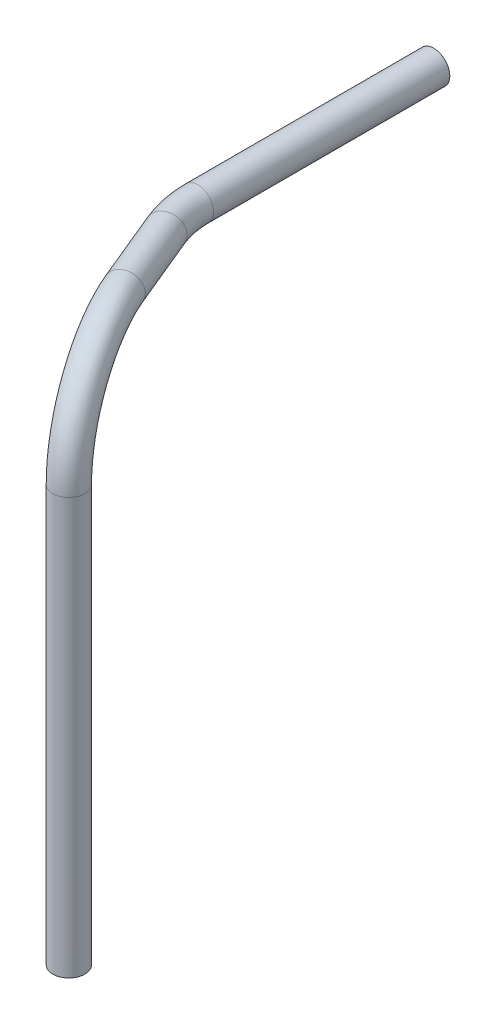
ISO-10303-21;
HEADER;
FILE_DESCRIPTION(('STEP AP214'),'2;1');
FILE_NAME('part.step','',(''),(''),'','','');
FILE_SCHEMA(('AUTOMOTIVE_DESIGN { 1 0 10303 214 1 1 1 1 }'));
ENDSEC;
DATA;
#1=APPLICATION_CONTEXT('core data for automotive mechanical design processes');
#2=APPLICATION_PROTOCOL_DEFINITION('international standard','automotive_design',2000,#1);
#3=PRODUCT_CONTEXT('',#1,'mechanical');
#4=PRODUCT('Part','Part','',(#3));
#5=PRODUCT_RELATED_PRODUCT_CATEGORY('part','',(#4));
#6=PRODUCT_DEFINITION_FORMATION('','',#4);
#7=PRODUCT_DEFINITION_CONTEXT('part definition',#1,'design');
#8=PRODUCT_DEFINITION('design','',#6,#7);
#9=PRODUCT_DEFINITION_SHAPE('','',#8);
#10=(LENGTH_UNIT() NAMED_UNIT(*) SI_UNIT(.MILLI.,.METRE.));
#11=(NAMED_UNIT(*) PLANE_ANGLE_UNIT() SI_UNIT($,.RADIAN.));
#12=(NAMED_UNIT(*) SI_UNIT($,.STERADIAN.) SOLID_ANGLE_UNIT());
#13=UNCERTAINTY_MEASURE_WITH_UNIT(LENGTH_MEASURE(1.E-05),#10,'distance_accuracy_value','');
#14=(GEOMETRIC_REPRESENTATION_CONTEXT(3) GLOBAL_UNCERTAINTY_ASSIGNED_CONTEXT((#13)) GLOBAL_UNIT_ASSIGNED_CONTEXT((#10,
#11,#12)) REPRESENTATION_CONTEXT('',''));
#15=CARTESIAN_POINT('',(0.,0.,0.));
#16=DIRECTION('',(0.,0.,1.));
#17=DIRECTION('',(1.,0.,0.));
#18=AXIS2_PLACEMENT_3D('',#15,#16,#17);
#19=CARTESIAN_POINT('',(37.9505773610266,-50.8,218.620798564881));
#20=DIRECTION('',(0.,-1.,0.));
#21=DIRECTION('',(0.,0.,-1.));
#22=AXIS2_PLACEMENT_3D('',#19,#20,#21);
#23=CYLINDRICAL_SURFACE('',#22,7.9375);
#24=CARTESIAN_POINT('',(37.9505773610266,-50.8,218.620798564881));
#25=DIRECTION('',(0.,-1.,0.));
#26=DIRECTION('',(0.923879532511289,0.,-0.382683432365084));
#27=AXIS2_PLACEMENT_3D('',#24,#25,#26);
#28=CIRCLE('',#27,7.9375);
#29=CARTESIAN_POINT('',(40.9881271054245,-50.8,225.95409235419));
#30=VERTEX_POINT('',#29);
#31=EDGE_CURVE('E43',#30,#30,#28,.T.);
#32=ORIENTED_EDGE('',*,*,#31,.T.);
#33=EDGE_LOOP('',(#32));
#34=FACE_BOUND('',#33,.T.);
#35=CARTESIAN_POINT('',(37.9505773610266,-256.851700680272,218.620798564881));
#36=DIRECTION('',(0.,-1.,0.));
#37=DIRECTION('',(0.923879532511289,0.,-0.382683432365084));
#38=AXIS2_PLACEMENT_3D('',#35,#36,#37);
#39=CIRCLE('',#38,7.9375);
#40=CARTESIAN_POINT('',(45.283871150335,-256.851700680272,215.583248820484));
#41=VERTEX_POINT('',#40);
#42=EDGE_CURVE('E10',#41,#41,#39,.T.);
#43=ORIENTED_EDGE('',*,*,#42,.F.);
#44=EDGE_LOOP('',(#43));
#45=FACE_BOUND('',#44,.T.);
#46=ADVANCED_FACE('F33',(#34,#45),#23,.T.);
#47=CARTESIAN_POINT('',(37.9505773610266,-50.8,218.620798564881));
#48=DIRECTION('',(0.,-1.,0.));
#49=DIRECTION('',(0.,0.,-1.));
#50=AXIS2_PLACEMENT_3D('',#47,#48,#49);
#51=CYLINDRICAL_SURFACE('',#50,4.86156);
#52=CARTESIAN_POINT('',(37.9505773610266,-50.8,218.620798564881));
#53=DIRECTION('',(0.,-1.,0.));
#54=DIRECTION('',(0.923879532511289,0.,-0.382683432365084));
#55=AXIS2_PLACEMENT_3D('',#52,#53,#54);
#56=CIRCLE('',#55,4.86156);
#57=CARTESIAN_POINT('',(39.8110158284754,-50.8,223.112294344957));
#58=VERTEX_POINT('',#57);
#59=EDGE_CURVE('E47',#58,#58,#56,.T.);
#60=ORIENTED_EDGE('',*,*,#59,.F.);
#61=EDGE_LOOP('',(#60));
#62=FACE_BOUND('',#61,.T.);
#63=CARTESIAN_POINT('',(37.9505773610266,-256.851700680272,218.620798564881));
#64=DIRECTION('',(0.,-1.,0.));
#65=DIRECTION('',(0.923879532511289,0.,-0.382683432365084));
#66=AXIS2_PLACEMENT_3D('',#63,#64,#65);
#67=CIRCLE('',#66,4.86156);
#68=CARTESIAN_POINT('',(42.4420731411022,-256.851700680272,216.760360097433));
#69=VERTEX_POINT('',#68);
#70=EDGE_CURVE('E39',#69,#69,#67,.T.);
#71=ORIENTED_EDGE('',*,*,#70,.T.);
#72=EDGE_LOOP('',(#71));
#73=FACE_BOUND('',#72,.T.);
#74=ADVANCED_FACE('F101',(#62,#73),#51,.F.);
#75=CARTESIAN_POINT('',(18.5102589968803,-50.8,171.687718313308));
#76=DIRECTION('',(0.923879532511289,0.,-0.382683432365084));
#77=DIRECTION('',(-0.382683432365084,0.,-0.923879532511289));
#78=AXIS2_PLACEMENT_3D('',#75,#76,#77);
#79=TOROIDAL_SURFACE('',#78,50.8,7.9375);
#80=CARTESIAN_POINT('',(18.5102589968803,0.,171.687718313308));
#81=DIRECTION('',(0.382683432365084,0.,0.923879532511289));
#82=DIRECTION('',(0.923879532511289,0.,-0.382683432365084));
#83=AXIS2_PLACEMENT_3D('',#80,#81,#82);
#84=CIRCLE('',#83,7.9375);
#85=CARTESIAN_POINT('',(18.5102589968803,7.93749999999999,171.687718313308));
#86=VERTEX_POINT('',#85);
#87=EDGE_CURVE('E52',#86,#86,#84,.T.);
#88=CARTESIAN_POINT('',(18.5102589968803,-50.8,171.687718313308));
#89=DIRECTION('',(0.923879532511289,0.,-0.382683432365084));
#90=DIRECTION('',(-0.382683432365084,0.,-0.923879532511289));
#91=AXIS2_PLACEMENT_3D('',#88,#89,#90);
#92=CIRCLE('',#91,58.7375);
#93=EDGE_CURVE('',#86,#30,#92,.T.);
#94=ORIENTED_EDGE('',*,*,#87,.T.);
#95=ORIENTED_EDGE('',*,*,#31,.F.);
#96=ORIENTED_EDGE('',*,*,#93,.T.);
#97=ORIENTED_EDGE('',*,*,#93,.F.);
#98=EDGE_LOOP('',(#94,#96,#95,#97));
#99=FACE_BOUND('',#98,.T.);
#100=ADVANCED_FACE('F97',(#99),#79,.T.);
#101=CARTESIAN_POINT('',(18.5102589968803,-50.8,171.687718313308));
#102=DIRECTION('',(0.923879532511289,0.,-0.382683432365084));
#103=DIRECTION('',(-0.382683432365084,0.,-0.923879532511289));
#104=AXIS2_PLACEMENT_3D('',#101,#102,#103);
#105=TOROIDAL_SURFACE('',#104,50.8,4.86156);
#106=CARTESIAN_POINT('',(18.5102589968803,0.,171.687718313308));
#107=DIRECTION('',(0.382683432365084,0.,0.923879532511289));
#108=DIRECTION('',(0.923879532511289,0.,-0.382683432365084));
#109=AXIS2_PLACEMENT_3D('',#106,#107,#108);
#110=CIRCLE('',#109,4.86156);
#111=CARTESIAN_POINT('',(18.5102589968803,4.86155999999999,171.687718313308));
#112=VERTEX_POINT('',#111);
#113=EDGE_CURVE('E55',#112,#112,#110,.T.);
#114=CARTESIAN_POINT('',(18.5102589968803,-50.8,171.687718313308));
#115=DIRECTION('',(0.923879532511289,0.,-0.382683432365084));
#116=DIRECTION('',(-0.382683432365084,0.,-0.923879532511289));
#117=AXIS2_PLACEMENT_3D('',#114,#115,#116);
#118=CIRCLE('',#117,55.66156);
#119=EDGE_CURVE('',#112,#58,#118,.T.);
#120=ORIENTED_EDGE('',*,*,#113,.F.);
#121=ORIENTED_EDGE('',*,*,#59,.T.);
#122=ORIENTED_EDGE('',*,*,#119,.T.);
#123=ORIENTED_EDGE('',*,*,#119,.F.);
#124=EDGE_LOOP('',(#120,#122,#121,#123));
#125=FACE_BOUND('',#124,.T.);
#126=ADVANCED_FACE('F94',(#125),#105,.F.);
#127=CARTESIAN_POINT('',(3.86691974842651,0.,136.33557010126));
#128=DIRECTION('',(0.382683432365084,0.,0.923879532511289));
#129=DIRECTION('',(0.923879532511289,0.,-0.382683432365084));
#130=AXIS2_PLACEMENT_3D('',#127,#128,#129);
#131=CYLINDRICAL_SURFACE('',#130,7.9375);
#132=CARTESIAN_POINT('',(3.86691974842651,0.,136.33557010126));
#133=DIRECTION('',(0.382683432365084,0.,0.923879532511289));
#134=DIRECTION('',(0.923879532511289,0.,-0.382683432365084));
#135=AXIS2_PLACEMENT_3D('',#132,#133,#134);
#136=CIRCLE('',#135,7.9375);
#137=CARTESIAN_POINT('',(-3.46637404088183,0.,139.373119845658));
#138=VERTEX_POINT('',#137);
#139=EDGE_CURVE('E58',#138,#138,#136,.T.);
#140=ORIENTED_EDGE('',*,*,#139,.T.);
#141=EDGE_LOOP('',(#140));
#142=FACE_BOUND('',#141,.T.);
#143=ORIENTED_EDGE('',*,*,#87,.F.);
#144=EDGE_LOOP('',(#143));
#145=FACE_BOUND('',#144,.T.);
#146=ADVANCED_FACE('F90',(#142,#145),#131,.T.);
#147=CARTESIAN_POINT('',(3.86691974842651,0.,136.33557010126));
#148=DIRECTION('',(0.382683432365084,0.,0.923879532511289));
#149=DIRECTION('',(0.923879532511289,0.,-0.382683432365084));
#150=AXIS2_PLACEMENT_3D('',#147,#148,#149);
#151=CYLINDRICAL_SURFACE('',#150,4.86156);
#152=CARTESIAN_POINT('',(3.86691974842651,0.,136.33557010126));
#153=DIRECTION('',(0.382683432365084,0.,0.923879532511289));
#154=DIRECTION('',(0.923879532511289,0.,-0.382683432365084));
#155=AXIS2_PLACEMENT_3D('',#152,#153,#154);
#156=CIRCLE('',#155,4.86156);
#157=CARTESIAN_POINT('',(-0.62457603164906,0.,138.196008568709));
#158=VERTEX_POINT('',#157);
#159=EDGE_CURVE('E61',#158,#158,#156,.T.);
#160=ORIENTED_EDGE('',*,*,#159,.F.);
#161=EDGE_LOOP('',(#160));
#162=FACE_BOUND('',#161,.T.);
#163=ORIENTED_EDGE('',*,*,#113,.T.);
#164=EDGE_LOOP('',(#163));
#165=FACE_BOUND('',#164,.T.);
#166=ADVANCED_FACE('F87',(#162,#165),#151,.F.);
#167=CARTESIAN_POINT('',(50.8,0.,116.895251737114));
#168=DIRECTION('',(0.,1.,0.));
#169=DIRECTION('',(-1.,0.,0.));
#170=AXIS2_PLACEMENT_3D('',#167,#168,#169);
#171=TOROIDAL_SURFACE('',#170,50.8,7.9375);
#172=CARTESIAN_POINT('',(0.,0.,116.895251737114));
#173=DIRECTION('',(0.,0.,1.));
#174=DIRECTION('',(1.,0.,0.));
#175=AXIS2_PLACEMENT_3D('',#172,#173,#174);
#176=CIRCLE('',#175,7.9375);
#177=CARTESIAN_POINT('',(-7.9375,0.,116.895251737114));
#178=VERTEX_POINT('',#177);
#179=EDGE_CURVE('E64',#178,#178,#176,.T.);
#180=CARTESIAN_POINT('',(50.8,0.,116.895251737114));
#181=DIRECTION('',(0.,1.,0.));
#182=DIRECTION('',(-1.,0.,0.));
#183=AXIS2_PLACEMENT_3D('',#180,#181,#182);
#184=CIRCLE('',#183,58.7375);
#185=EDGE_CURVE('',#178,#138,#184,.T.);
#186=ORIENTED_EDGE('',*,*,#179,.T.);
#187=ORIENTED_EDGE('',*,*,#139,.F.);
#188=ORIENTED_EDGE('',*,*,#185,.T.);
#189=ORIENTED_EDGE('',*,*,#185,.F.);
#190=EDGE_LOOP('',(#186,#188,#187,#189));
#191=FACE_BOUND('',#190,.T.);
#192=ADVANCED_FACE('F83',(#191),#171,.T.);
#193=CARTESIAN_POINT('',(50.8,0.,116.895251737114));
#194=DIRECTION('',(0.,1.,0.));
#195=DIRECTION('',(-1.,0.,0.));
#196=AXIS2_PLACEMENT_3D('',#193,#194,#195);
#197=TOROIDAL_SURFACE('',#196,50.8,4.86156);
#198=CARTESIAN_POINT('',(0.,0.,116.895251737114));
#199=DIRECTION('',(0.,0.,1.));
#200=DIRECTION('',(1.,0.,0.));
#201=AXIS2_PLACEMENT_3D('',#198,#199,#200);
#202=CIRCLE('',#201,4.86156);
#203=CARTESIAN_POINT('',(-4.86156,0.,116.895251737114));
#204=VERTEX_POINT('',#203);
#205=EDGE_CURVE('E68',#204,#204,#202,.T.);
#206=CARTESIAN_POINT('',(50.8,0.,116.895251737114));
#207=DIRECTION('',(0.,1.,0.));
#208=DIRECTION('',(-1.,0.,0.));
#209=AXIS2_PLACEMENT_3D('',#206,#207,#208);
#210=CIRCLE('',#209,55.66156);
#211=EDGE_CURVE('',#204,#158,#210,.T.);
#212=ORIENTED_EDGE('',*,*,#205,.F.);
#213=ORIENTED_EDGE('',*,*,#159,.T.);
#214=ORIENTED_EDGE('',*,*,#211,.T.);
#215=ORIENTED_EDGE('',*,*,#211,.F.);
#216=EDGE_LOOP('',(#212,#214,#213,#215));
#217=FACE_BOUND('',#216,.T.);
#218=ADVANCED_FACE('F80',(#217),#197,.F.);
#219=CARTESIAN_POINT('',(0.,0.,116.895251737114));
#220=DIRECTION('',(0.,0.,-1.));
#221=DIRECTION('',(0.,1.,0.));
#222=AXIS2_PLACEMENT_3D('',#219,#220,#221);
#223=CYLINDRICAL_SURFACE('',#222,4.86156);
#224=ORIENTED_EDGE('',*,*,#205,.T.);
#225=EDGE_LOOP('',(#224));
#226=FACE_BOUND('',#225,.T.);
#227=CARTESIAN_POINT('',(0.,0.,0.));
#228=DIRECTION('',(0.,0.,1.));
#229=DIRECTION('',(1.,0.,0.));
#230=AXIS2_PLACEMENT_3D('',#227,#228,#229);
#231=CIRCLE('',#230,4.86156);
#232=CARTESIAN_POINT('',(4.86156,0.,0.));
#233=VERTEX_POINT('',#232);
#234=EDGE_CURVE('E69',#233,#233,#231,.T.);
#235=ORIENTED_EDGE('',*,*,#234,.F.);
#236=EDGE_LOOP('',(#235));
#237=FACE_BOUND('',#236,.T.);
#238=ADVANCED_FACE('F77',(#226,#237),#223,.F.);
#239=CARTESIAN_POINT('',(0.,0.,116.895251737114));
#240=DIRECTION('',(0.,0.,-1.));
#241=DIRECTION('',(0.,1.,0.));
#242=AXIS2_PLACEMENT_3D('',#239,#240,#241);
#243=CYLINDRICAL_SURFACE('',#242,7.9375);
#244=ORIENTED_EDGE('',*,*,#179,.F.);
#245=EDGE_LOOP('',(#244));
#246=FACE_BOUND('',#245,.T.);
#247=CARTESIAN_POINT('',(0.,0.,0.));
#248=DIRECTION('',(0.,0.,1.));
#249=DIRECTION('',(1.,0.,0.));
#250=AXIS2_PLACEMENT_3D('',#247,#248,#249);
#251=CIRCLE('',#250,7.9375);
#252=CARTESIAN_POINT('',(7.9375,0.,0.));
#253=VERTEX_POINT('',#252);
#254=EDGE_CURVE('E65',#253,#253,#251,.T.);
#255=ORIENTED_EDGE('',*,*,#254,.T.);
#256=EDGE_LOOP('',(#255));
#257=FACE_BOUND('',#256,.T.);
#258=ADVANCED_FACE('F119',(#246,#257),#243,.T.);
#259=CARTESIAN_POINT('',(37.9505773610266,-256.851700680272,218.620798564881));
#260=DIRECTION('',(0.,-1.,0.));
#261=DIRECTION('',(0.923879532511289,0.,-0.382683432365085));
#262=AXIS2_PLACEMENT_3D('',#259,#260,#261);
#263=PLANE('',#262);
#264=ORIENTED_EDGE('',*,*,#70,.F.);
#265=EDGE_LOOP('',(#264));
#266=FACE_BOUND('',#265,.T.);
#267=ORIENTED_EDGE('',*,*,#42,.T.);
#268=EDGE_LOOP('',(#267));
#269=FACE_BOUND('',#268,.T.);
#270=ADVANCED_FACE('F122',(#266,#269),#263,.T.);
#271=CARTESIAN_POINT('',(0.,0.,0.));
#272=DIRECTION('',(0.,0.,1.));
#273=DIRECTION('',(1.,0.,0.));
#274=AXIS2_PLACEMENT_3D('',#271,#272,#273);
#275=PLANE('',#274);
#276=ORIENTED_EDGE('',*,*,#234,.T.);
#277=EDGE_LOOP('',(#276));
#278=FACE_BOUND('',#277,.T.);
#279=ORIENTED_EDGE('',*,*,#254,.F.);
#280=EDGE_LOOP('',(#279));
#281=FACE_BOUND('',#280,.T.);
#282=ADVANCED_FACE('F124',(#278,#281),#275,.F.);
#283=CLOSED_SHELL('',(#46,#74,#100,#126,#146,#166,#192,#218,#238,#258,#270,#282));
#284=MANIFOLD_SOLID_BREP('B2',#283);
#285=ADVANCED_BREP_SHAPE_REPRESENTATION('',(#18,#284),#14);
#286=SHAPE_DEFINITION_REPRESENTATION(#9,#285);
ENDSEC;
END-ISO-10303-21;
